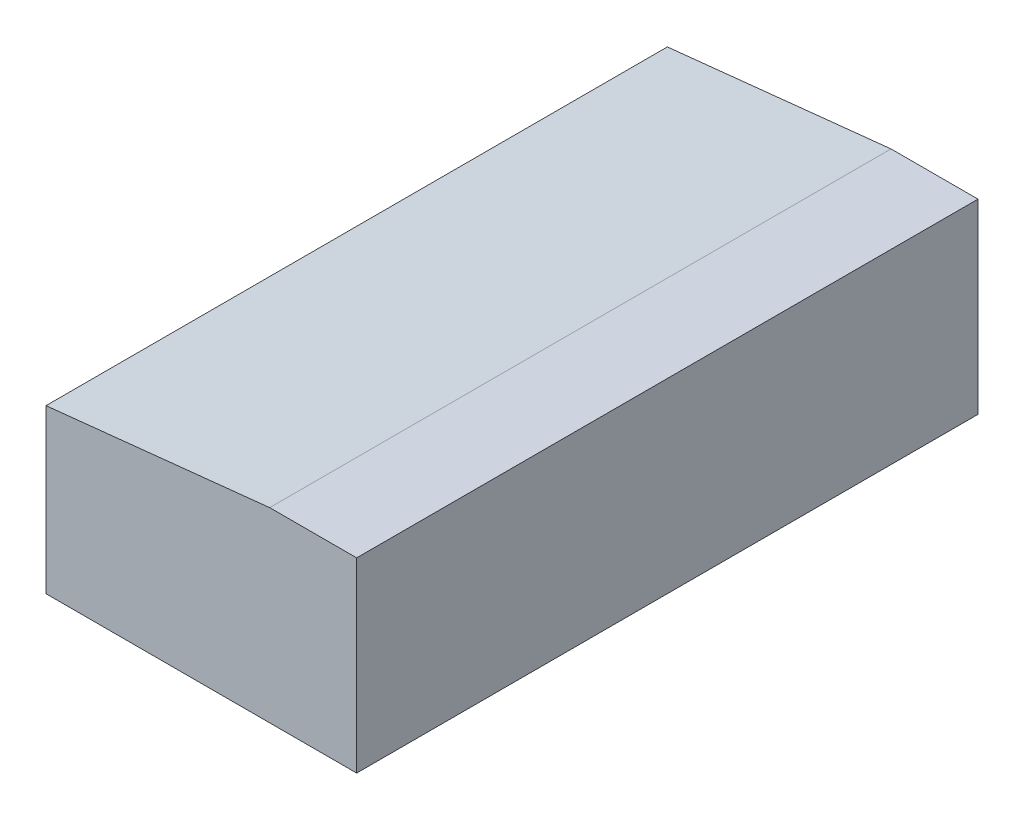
ISO-10303-21;
HEADER;
FILE_DESCRIPTION(('STEP AP214'),'2;1');
FILE_NAME('part.step','',(''),(''),'','','');
FILE_SCHEMA(('AUTOMOTIVE_DESIGN { 1 0 10303 214 1 1 1 1 }'));
ENDSEC;
DATA;
#1=APPLICATION_CONTEXT('core data for automotive mechanical design processes');
#2=APPLICATION_PROTOCOL_DEFINITION('international standard','automotive_design',2000,#1);
#3=PRODUCT_CONTEXT('',#1,'mechanical');
#4=PRODUCT('Part','Part','',(#3));
#5=PRODUCT_RELATED_PRODUCT_CATEGORY('part','',(#4));
#6=PRODUCT_DEFINITION_FORMATION('','',#4);
#7=PRODUCT_DEFINITION_CONTEXT('part definition',#1,'design');
#8=PRODUCT_DEFINITION('design','',#6,#7);
#9=PRODUCT_DEFINITION_SHAPE('','',#8);
#10=(LENGTH_UNIT() NAMED_UNIT(*) SI_UNIT(.MILLI.,.METRE.));
#11=(NAMED_UNIT(*) PLANE_ANGLE_UNIT() SI_UNIT($,.RADIAN.));
#12=(NAMED_UNIT(*) SI_UNIT($,.STERADIAN.) SOLID_ANGLE_UNIT());
#13=UNCERTAINTY_MEASURE_WITH_UNIT(LENGTH_MEASURE(1.E-05),#10,'distance_accuracy_value','');
#14=(GEOMETRIC_REPRESENTATION_CONTEXT(3) GLOBAL_UNCERTAINTY_ASSIGNED_CONTEXT((#13)) GLOBAL_UNIT_ASSIGNED_CONTEXT((#10,
#11,#12)) REPRESENTATION_CONTEXT('',''));
#15=CARTESIAN_POINT('',(0.,0.,0.));
#16=DIRECTION('',(0.,0.,1.));
#17=DIRECTION('',(1.,0.,0.));
#18=AXIS2_PLACEMENT_3D('',#15,#16,#17);
#19=CARTESIAN_POINT('',(0.,0.,50.));
#20=DIRECTION('',(1.,0.,0.));
#21=DIRECTION('',(0.,0.,-1.));
#22=AXIS2_PLACEMENT_3D('',#19,#20,#21);
#23=PLANE('',#22);
#24=DIRECTION('',(0.,-1.,0.));
#25=VECTOR('',#24,1.);
#26=CARTESIAN_POINT('',(0.,0.,0.));
#27=LINE('',#26,#25);
#28=CARTESIAN_POINT('',(0.,13.1081237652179,0.));
#29=VERTEX_POINT('',#28);
#30=CARTESIAN_POINT('',(0.,0.,0.));
#31=VERTEX_POINT('',#30);
#32=EDGE_CURVE('E76',#29,#31,#27,.T.);
#33=ORIENTED_EDGE('',*,*,#32,.T.);
#34=DIRECTION('',(0.,0.,-1.));
#35=VECTOR('',#34,1.);
#36=CARTESIAN_POINT('',(0.,0.,50.));
#37=LINE('',#36,#35);
#38=CARTESIAN_POINT('',(0.,0.,50.));
#39=VERTEX_POINT('',#38);
#40=EDGE_CURVE('E11',#39,#31,#37,.T.);
#41=ORIENTED_EDGE('',*,*,#40,.F.);
#42=DIRECTION('',(0.,-1.,0.));
#43=VECTOR('',#42,1.);
#44=CARTESIAN_POINT('',(0.,0.,50.));
#45=LINE('',#44,#43);
#46=CARTESIAN_POINT('',(0.,13.1081237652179,50.));
#47=VERTEX_POINT('',#46);
#48=EDGE_CURVE('E97',#47,#39,#45,.T.);
#49=ORIENTED_EDGE('',*,*,#48,.F.);
#50=DIRECTION('',(0.,0.,-1.));
#51=VECTOR('',#50,1.);
#52=CARTESIAN_POINT('',(0.,13.1081237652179,50.));
#53=LINE('',#52,#51);
#54=EDGE_CURVE('E89',#47,#29,#53,.T.);
#55=ORIENTED_EDGE('',*,*,#54,.T.);
#56=EDGE_LOOP('',(#33,#41,#49,#55));
#57=FACE_BOUND('',#56,.T.);
#58=ADVANCED_FACE('F26',(#57),#23,.F.);
#59=CARTESIAN_POINT('',(25.,0.,50.));
#60=DIRECTION('',(0.,1.,0.));
#61=DIRECTION('',(0.,0.,1.));
#62=AXIS2_PLACEMENT_3D('',#59,#60,#61);
#63=PLANE('',#62);
#64=DIRECTION('',(1.,0.,0.));
#65=VECTOR('',#64,1.);
#66=CARTESIAN_POINT('',(25.,0.,0.));
#67=LINE('',#66,#65);
#68=CARTESIAN_POINT('',(25.,0.,0.));
#69=VERTEX_POINT('',#68);
#70=EDGE_CURVE('E72',#31,#69,#67,.T.);
#71=ORIENTED_EDGE('',*,*,#70,.T.);
#72=DIRECTION('',(0.,0.,-1.));
#73=VECTOR('',#72,1.);
#74=CARTESIAN_POINT('',(25.,0.,50.));
#75=LINE('',#74,#73);
#76=CARTESIAN_POINT('',(25.,0.,50.));
#77=VERTEX_POINT('',#76);
#78=EDGE_CURVE('E33',#77,#69,#75,.T.);
#79=ORIENTED_EDGE('',*,*,#78,.F.);
#80=DIRECTION('',(1.,0.,0.));
#81=VECTOR('',#80,1.);
#82=CARTESIAN_POINT('',(25.,0.,50.));
#83=LINE('',#82,#81);
#84=EDGE_CURVE('E85',#39,#77,#83,.T.);
#85=ORIENTED_EDGE('',*,*,#84,.F.);
#86=ORIENTED_EDGE('',*,*,#40,.T.);
#87=EDGE_LOOP('',(#71,#79,#85,#86));
#88=FACE_BOUND('',#87,.T.);
#89=ADVANCED_FACE('F84',(#88),#63,.F.);
#90=CARTESIAN_POINT('',(25.,15.,50.));
#91=DIRECTION('',(-1.,0.,0.));
#92=DIRECTION('',(0.,0.,1.));
#93=AXIS2_PLACEMENT_3D('',#90,#91,#92);
#94=PLANE('',#93);
#95=DIRECTION('',(0.,1.,0.));
#96=VECTOR('',#95,1.);
#97=CARTESIAN_POINT('',(25.,15.,0.));
#98=LINE('',#97,#96);
#99=CARTESIAN_POINT('',(25.,15.,0.));
#100=VERTEX_POINT('',#99);
#101=EDGE_CURVE('E78',#69,#100,#98,.T.);
#102=ORIENTED_EDGE('',*,*,#101,.T.);
#103=DIRECTION('',(0.,0.,-1.));
#104=VECTOR('',#103,1.);
#105=CARTESIAN_POINT('',(25.,15.,50.));
#106=LINE('',#105,#104);
#107=CARTESIAN_POINT('',(25.,15.,50.));
#108=VERTEX_POINT('',#107);
#109=EDGE_CURVE('E108',#108,#100,#106,.T.);
#110=ORIENTED_EDGE('',*,*,#109,.F.);
#111=DIRECTION('',(0.,1.,0.));
#112=VECTOR('',#111,1.);
#113=CARTESIAN_POINT('',(25.,15.,50.));
#114=LINE('',#113,#112);
#115=EDGE_CURVE('E100',#77,#108,#114,.T.);
#116=ORIENTED_EDGE('',*,*,#115,.F.);
#117=ORIENTED_EDGE('',*,*,#78,.T.);
#118=EDGE_LOOP('',(#102,#110,#116,#117));
#119=FACE_BOUND('',#118,.T.);
#120=ADVANCED_FACE('F112',(#119),#94,.F.);
#121=CARTESIAN_POINT('',(18.,15.,50.));
#122=DIRECTION('',(0.,-1.,0.));
#123=DIRECTION('',(1.,0.,0.));
#124=AXIS2_PLACEMENT_3D('',#121,#122,#123);
#125=PLANE('',#124);
#126=DIRECTION('',(-1.,0.,0.));
#127=VECTOR('',#126,1.);
#128=CARTESIAN_POINT('',(18.,15.,0.));
#129=LINE('',#128,#127);
#130=CARTESIAN_POINT('',(18.,15.,0.));
#131=VERTEX_POINT('',#130);
#132=EDGE_CURVE('E93',#100,#131,#129,.T.);
#133=ORIENTED_EDGE('',*,*,#132,.T.);
#134=DIRECTION('',(0.,0.,-1.));
#135=VECTOR('',#134,1.);
#136=CARTESIAN_POINT('',(18.,15.,50.));
#137=LINE('',#136,#135);
#138=CARTESIAN_POINT('',(18.,15.,50.));
#139=VERTEX_POINT('',#138);
#140=EDGE_CURVE('E105',#139,#131,#137,.T.);
#141=ORIENTED_EDGE('',*,*,#140,.F.);
#142=DIRECTION('',(-1.,0.,0.));
#143=VECTOR('',#142,1.);
#144=CARTESIAN_POINT('',(18.,15.,50.));
#145=LINE('',#144,#143);
#146=EDGE_CURVE('E45',#108,#139,#145,.T.);
#147=ORIENTED_EDGE('',*,*,#146,.F.);
#148=ORIENTED_EDGE('',*,*,#109,.T.);
#149=EDGE_LOOP('',(#133,#141,#147,#148));
#150=FACE_BOUND('',#149,.T.);
#151=ADVANCED_FACE('F123',(#150),#125,.F.);
#152=CARTESIAN_POINT('',(0.,13.1081237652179,50.));
#153=DIRECTION('',(0.104528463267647,-0.994521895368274,0.));
#154=DIRECTION('',(0.994521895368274,0.104528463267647,0.));
#155=AXIS2_PLACEMENT_3D('',#152,#153,#154);
#156=PLANE('',#155);
#157=DIRECTION('',(-0.994521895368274,-0.104528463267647,0.));
#158=VECTOR('',#157,1.);
#159=CARTESIAN_POINT('',(0.,13.1081237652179,0.));
#160=LINE('',#159,#158);
#161=EDGE_CURVE('E95',#131,#29,#160,.T.);
#162=ORIENTED_EDGE('',*,*,#161,.T.);
#163=ORIENTED_EDGE('',*,*,#54,.F.);
#164=DIRECTION('',(-0.994521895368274,-0.104528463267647,0.));
#165=VECTOR('',#164,1.);
#166=CARTESIAN_POINT('',(0.,13.1081237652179,50.));
#167=LINE('',#166,#165);
#168=EDGE_CURVE('E40',#139,#47,#167,.T.);
#169=ORIENTED_EDGE('',*,*,#168,.F.);
#170=ORIENTED_EDGE('',*,*,#140,.T.);
#171=EDGE_LOOP('',(#162,#163,#169,#170));
#172=FACE_BOUND('',#171,.T.);
#173=ADVANCED_FACE('F116',(#172),#156,.F.);
#174=CARTESIAN_POINT('',(0.,0.,50.));
#175=DIRECTION('',(0.,0.,1.));
#176=DIRECTION('',(1.,0.,0.));
#177=AXIS2_PLACEMENT_3D('',#174,#175,#176);
#178=PLANE('',#177);
#179=ORIENTED_EDGE('',*,*,#48,.T.);
#180=ORIENTED_EDGE('',*,*,#84,.T.);
#181=ORIENTED_EDGE('',*,*,#115,.T.);
#182=ORIENTED_EDGE('',*,*,#146,.T.);
#183=ORIENTED_EDGE('',*,*,#168,.T.);
#184=EDGE_LOOP('',(#179,#180,#181,#182,#183));
#185=FACE_BOUND('',#184,.T.);
#186=ADVANCED_FACE('F114',(#185),#178,.T.);
#187=CARTESIAN_POINT('',(0.,0.,0.));
#188=DIRECTION('',(0.,0.,1.));
#189=DIRECTION('',(1.,0.,0.));
#190=AXIS2_PLACEMENT_3D('',#187,#188,#189);
#191=PLANE('',#190);
#192=ORIENTED_EDGE('',*,*,#32,.F.);
#193=ORIENTED_EDGE('',*,*,#161,.F.);
#194=ORIENTED_EDGE('',*,*,#132,.F.);
#195=ORIENTED_EDGE('',*,*,#101,.F.);
#196=ORIENTED_EDGE('',*,*,#70,.F.);
#197=EDGE_LOOP('',(#192,#193,#194,#195,#196));
#198=FACE_BOUND('',#197,.T.);
#199=ADVANCED_FACE('F73',(#198),#191,.F.);
#200=CLOSED_SHELL('',(#58,#89,#120,#151,#173,#186,#199));
#201=MANIFOLD_SOLID_BREP('B2',#200);
#202=ADVANCED_BREP_SHAPE_REPRESENTATION('',(#18,#201),#14);
#203=SHAPE_DEFINITION_REPRESENTATION(#9,#202);
ENDSEC;
END-ISO-10303-21;
